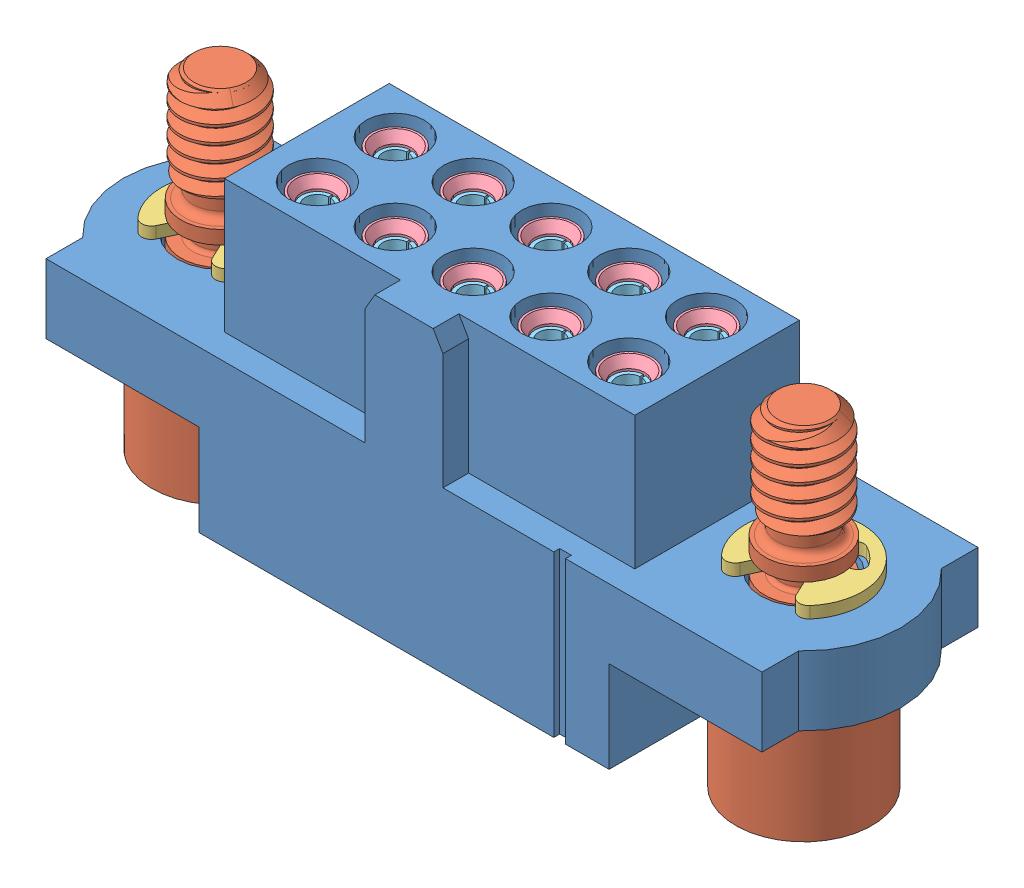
SolidWorks assembly m80-4811005_asm.SLDASM, configuration Default (file format 8000). Lengths in mm.
Overall size (20 8.5 5.55).
36 component instances, 5 part files, 0 mates.
Components (placement in the parent):
- M80-2662098_ASM-1: M80-2662098_ASM.sldasm [Default] at origin size (20 8.5 5.55)
  - M80-2625098-1: M80-2625098.sldprt [Default] at origin size (20 7.55 5.55)
  - M80-218-1: M80-218.sldprt [Default] at (7.5 -5.2 0) x (0.866025 0 -0.5) z (-0.5 0 -0.866025) size (3.5 8.5 3.5)
  - M80-218-2: M80-218.sldprt [Default] at (-7.5 -5.2 0) x (0.866025 0 0.5) z (0.5 0 -0.866025) size (3.5 8.5 3.5)
  - M80-215-1: M80-215.sldprt [Default] at (7.5 -3.12 0) size (3 0.3 2.57)
  - M80-215-2: M80-215.sldprt [Default] at (-7.5 -3.12 0) size (3 0.3 2.57)
- M80-013_ASM-1: M80-013_ASM.sldasm [Default] at (-4 -7.65 -1) x (-1 0 0) z (0 0 1) size (1.48 7.45 1.48)
  - M80-012-1: M80-012.sldprt [Default] at origin size (1.48 7.45 1.48)
  - Y3198-1: Y3198.sldprt [Default] at (0 -6.44 0) x (-1 0 0) z (0 0 1) size (0.86 1.68 0.86)
- M80-013_ASM-2: M80-013_ASM.sldasm [Default] at (-2 -7.65 -1) x (-1 0 0) z (0 0 1) size (1.48 7.45 1.48)
  - M80-012-1: M80-012.sldprt [Default] at origin size (1.48 7.45 1.48)
  - Y3198-1: Y3198.sldprt [Default] at (0 -6.44 0) x (-1 0 0) z (0 0 1) size (0.86 1.68 0.86)
- M80-013_ASM-3: M80-013_ASM.sldasm [Default] at (0 -7.65 -1) x (-1 0 0) z (0 0 1) size (1.48 7.45 1.48)
  - M80-012-1: M80-012.sldprt [Default] at origin size (1.48 7.45 1.48)
  - Y3198-1: Y3198.sldprt [Default] at (0 -6.44 0) x (-1 0 0) z (0 0 1) size (0.86 1.68 0.86)
- M80-013_ASM-4: M80-013_ASM.sldasm [Default] at (2 -7.65 -1) x (-1 0 0) z (0 0 1) size (1.48 7.45 1.48)
  - M80-012-1: M80-012.sldprt [Default] at origin size (1.48 7.45 1.48)
  - Y3198-1: Y3198.sldprt [Default] at (0 -6.44 0) x (-1 0 0) z (0 0 1) size (0.86 1.68 0.86)
- M80-013_ASM-5: M80-013_ASM.sldasm [Default] at (4 -7.65 -1) x (-1 0 0) z (0 0 1) size (1.48 7.45 1.48)
  - M80-012-1: M80-012.sldprt [Default] at origin size (1.48 7.45 1.48)
  - Y3198-1: Y3198.sldprt [Default] at (0 -6.44 0) x (-1 0 0) z (0 0 1) size (0.86 1.68 0.86)
- M80-013_ASM-6: M80-013_ASM.sldasm [Default] at (-4 -7.65 1) x (-1 0 0) z (0 0 1) size (1.48 7.45 1.48)
  - M80-012-1: M80-012.sldprt [Default] at origin size (1.48 7.45 1.48)
  - Y3198-1: Y3198.sldprt [Default] at (0 -6.44 0) x (-1 0 0) z (0 0 1) size (0.86 1.68 0.86)
- M80-013_ASM-7: M80-013_ASM.sldasm [Default] at (-2 -7.65 1) x (-1 0 0) z (0 0 1) size (1.48 7.45 1.48)
  - M80-012-1: M80-012.sldprt [Default] at origin size (1.48 7.45 1.48)
  - Y3198-1: Y3198.sldprt [Default] at (0 -6.44 0) x (-1 0 0) z (0 0 1) size (0.86 1.68 0.86)
- M80-013_ASM-8: M80-013_ASM.sldasm [Default] at (0 -7.65 1) x (-1 0 0) z (0 0 1) size (1.48 7.45 1.48)
  - M80-012-1: M80-012.sldprt [Default] at origin size (1.48 7.45 1.48)
  - Y3198-1: Y3198.sldprt [Default] at (0 -6.44 0) x (-1 0 0) z (0 0 1) size (0.86 1.68 0.86)
- M80-013_ASM-9: M80-013_ASM.sldasm [Default] at (2 -7.65 1) x (-1 0 0) z (0 0 1) size (1.48 7.45 1.48)
  - M80-012-1: M80-012.sldprt [Default] at origin size (1.48 7.45 1.48)
  - Y3198-1: Y3198.sldprt [Default] at (0 -6.44 0) x (-1 0 0) z (0 0 1) size (0.86 1.68 0.86)
- M80-013_ASM-10: M80-013_ASM.sldasm [Default] at (4 -7.65 1) x (-1 0 0) z (0 0 1) size (1.48 7.45 1.48)
  - M80-012-1: M80-012.sldprt [Default] at origin size (1.48 7.45 1.48)
  - Y3198-1: Y3198.sldprt [Default] at (0 -6.44 0) x (-1 0 0) z (0 0 1) size (0.86 1.68 0.86)
